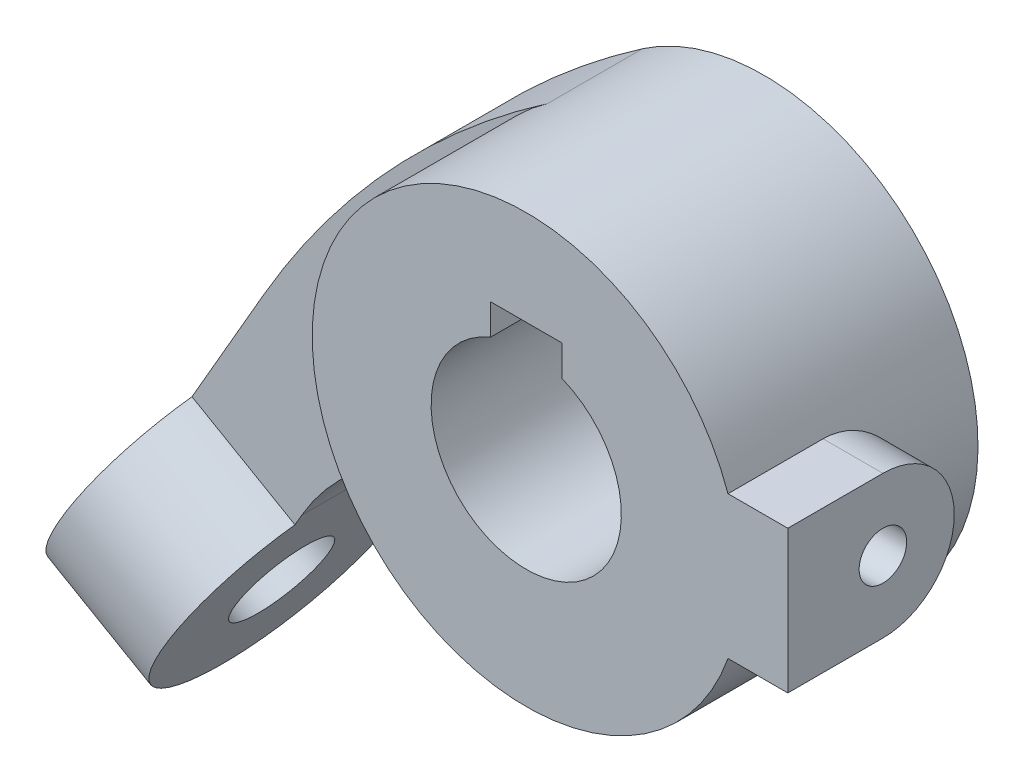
from build123d import *

# Parameters (mm, degrees)
SKETCH_1_R           = 18
EXTRUDE_1_DEPTH      = 20
EXTRUDE_2_REACH      = 50.208
EXTRUDE_2_END_RADIUS = 18
SKETCH_2_R           = 2
EXTRUDE_3_DEPTH      = 8
SKETCH_4_R           = 10
EXTRUDE_4_DEPTH      = 10
SKETCH_5_R           = 4
CUT_EXTRUDE_1_DEPTH  = 11


with BuildPart() as part:
    # Sketch 1 → Extrude 1 (new body)
    with BuildSketch(Plane.XY):
        Circle(SKETCH_1_R)
        with BuildLine():
            Line((-3, 7.416198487), (-3, 10))
            Line((-3, 10), (3, 10))
            Line((3, 10), (3, 7.416198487))
            ThreePointArc((3, 7.416198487), (0, -8), (-3, 7.416198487))
        make_face(mode=Mode.SUBTRACT)
    extrude(amount=EXTRUDE_1_DEPTH)

    # Extrude 2: up to this cylinder (the profile starts outside it)
    extrude_2_end = Plane(origin=(0, 0, 6.184391), z_dir=(0, 0, -1)) * Cylinder(EXTRUDE_2_END_RADIUS, 137.416, mode=Mode.PRIVATE)
    # Sketch 2 → Extrude 2 (add, up to the surface)
    with BuildSketch(Plane(origin=(22, 0, 0), x_dir=(0, 0, -1), z_dir=(1, 0, 0)), mode=Mode.PRIVATE) as extrude_2_sk1:
        with BuildLine():
            Line((-12, 6), (-20, 6))
            Line((-20, 6), (-20, -6))
            Line((-20, -6), (-12, -6))
            ThreePointArc((-12, -6), (-6, 0), (-12, 6))
        make_face()
        with Locations((-12, 0)):
            Circle(SKETCH_2_R, mode=Mode.SUBTRACT)
    extrude_2_tool1 = extrude(extrude_2_sk1.sketch, amount=-EXTRUDE_2_REACH, mode=Mode.PRIVATE) - extrude_2_end
    add(extrude_2_tool1.solids().sort_by_distance((22, 0, 6.184391))[0])

    # Sketch 3 → Extrude 3 (add)
    with BuildSketch(Plane.XY):
        with BuildLine():
            Line((-34.088744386, -11.043437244), (-44.784609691, -29.569219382))
            Line((-44.784609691, -29.569219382), (-36.124355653, -34.569219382))
            Line((-36.124355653, -34.569219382), (-30.886018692, -25.496153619))
            ThreePointArc((-30.886018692, -25.496153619), (-20.255584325, -16.648264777), (-6.425768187, -16.813967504))
            ThreePointArc((-6.425768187, -16.813967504), (-17.872072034, -2.142204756), (-10.217406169, 14.819062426))
            ThreePointArc((-10.217406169, 14.819062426), (-23.592957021, 3.216837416), (-34.088744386, -11.043437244))
        make_face()
    extrude(amount=EXTRUDE_3_DEPTH)

    # Sketch 4 → Extrude 4 (add)
    with BuildSketch(Plane(origin=(-20.784609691, 12, 0), x_dir=(0, 0, 1), z_dir=(-0.8660254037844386, 0.5000000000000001, 0))):
        with Locations((4.443645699, -48)):
            Circle(SKETCH_4_R)
    extrude(amount=-EXTRUDE_4_DEPTH)

    # Sketch 5 → Cut-Extrude 1 (cut)
    with BuildSketch(Plane(origin=(-20.784609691, 12, 0), x_dir=(0, 0, 1), z_dir=(-0.8660254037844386, 0.5000000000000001, 0))):
        with Locations(Location((4.443645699, -48, 0), (0, 0, 270))):
            Circle(SKETCH_5_R)
    extrude(amount=-CUT_EXTRUDE_1_DEPTH, mode=Mode.SUBTRACT)


solid = part.part
